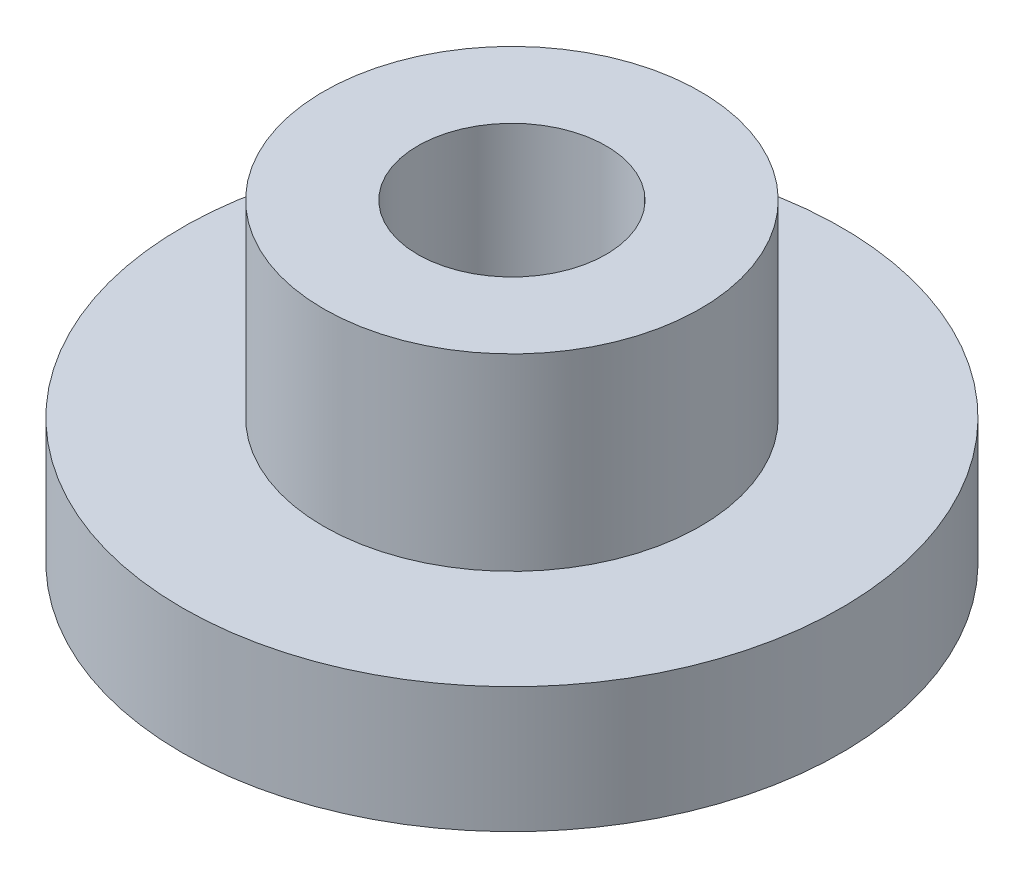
from build123d import *


with BuildPart() as part:
    # Esquisse1 → R_volution1 (revolve)
    with BuildSketch(Plane.XY, mode=Mode.PRIVATE) as r_volution1_sk:
        Polygon((0, -2), (-5.25, -2), (-5.25, 0), (-3, 0), (-3, 3), (-1.5, 3), (-1.5, 0.866025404), (0, 0), align=None)
    revolve(r_volution1_sk.sketch.rotate(Axis((0, 27.270256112, 0), (0, -1, 0)), 270), axis=Axis((0, 27.270256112, 0), (0, -1, 0)))


solid = part.part
